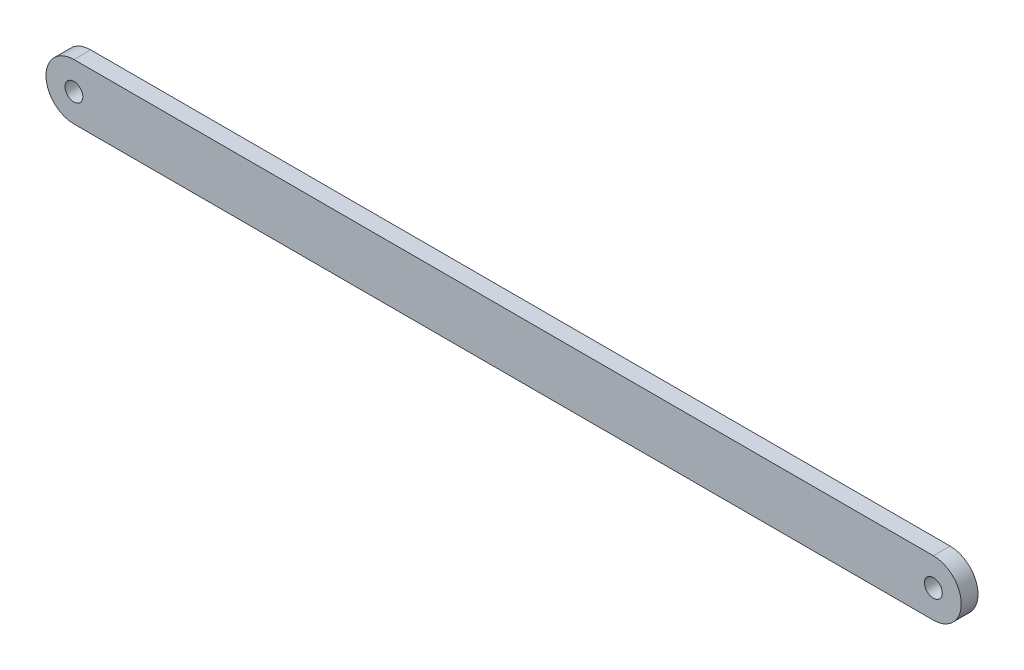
ISO-10303-21;
HEADER;
FILE_DESCRIPTION(('STEP AP214'),'2;1');
FILE_NAME('part.step','',(''),(''),'','','');
FILE_SCHEMA(('AUTOMOTIVE_DESIGN { 1 0 10303 214 1 1 1 1 }'));
ENDSEC;
DATA;
#1=APPLICATION_CONTEXT('core data for automotive mechanical design processes');
#2=APPLICATION_PROTOCOL_DEFINITION('international standard','automotive_design',2000,#1);
#3=PRODUCT_CONTEXT('',#1,'mechanical');
#4=PRODUCT('Part','Part','',(#3));
#5=PRODUCT_RELATED_PRODUCT_CATEGORY('part','',(#4));
#6=PRODUCT_DEFINITION_FORMATION('','',#4);
#7=PRODUCT_DEFINITION_CONTEXT('part definition',#1,'design');
#8=PRODUCT_DEFINITION('design','',#6,#7);
#9=PRODUCT_DEFINITION_SHAPE('','',#8);
#10=(LENGTH_UNIT() NAMED_UNIT(*) SI_UNIT(.MILLI.,.METRE.));
#11=(NAMED_UNIT(*) PLANE_ANGLE_UNIT() SI_UNIT($,.RADIAN.));
#12=(NAMED_UNIT(*) SI_UNIT($,.STERADIAN.) SOLID_ANGLE_UNIT());
#13=UNCERTAINTY_MEASURE_WITH_UNIT(LENGTH_MEASURE(1.E-05),#10,'distance_accuracy_value','');
#14=(GEOMETRIC_REPRESENTATION_CONTEXT(3) GLOBAL_UNCERTAINTY_ASSIGNED_CONTEXT((#13)) GLOBAL_UNIT_ASSIGNED_CONTEXT((#10,
#11,#12)) REPRESENTATION_CONTEXT('',''));
#15=CARTESIAN_POINT('',(0.,0.,0.));
#16=DIRECTION('',(0.,0.,1.));
#17=DIRECTION('',(1.,0.,0.));
#18=AXIS2_PLACEMENT_3D('',#15,#16,#17);
#19=CARTESIAN_POINT('',(180.,26.,3.));
#20=DIRECTION('',(0.,0.,1.));
#21=DIRECTION('',(1.,0.,0.));
#22=AXIS2_PLACEMENT_3D('',#19,#20,#21);
#23=PLANE('',#22);
#24=CARTESIAN_POINT('',(180.,26.,3.));
#25=DIRECTION('',(0.,0.,1.));
#26=DIRECTION('',(1.,0.,0.));
#27=AXIS2_PLACEMENT_3D('',#24,#25,#26);
#28=CIRCLE('',#27,1.60000000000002);
#29=CARTESIAN_POINT('',(181.6,26.,3.));
#30=VERTEX_POINT('',#29);
#31=EDGE_CURVE('E99',#30,#30,#28,.T.);
#32=ORIENTED_EDGE('',*,*,#31,.F.);
#33=EDGE_LOOP('',(#32));
#34=FACE_BOUND('',#33,.T.);
#35=CARTESIAN_POINT('',(180.,26.,3.));
#36=DIRECTION('',(0.,0.,1.));
#37=DIRECTION('',(1.,0.,0.));
#38=AXIS2_PLACEMENT_3D('',#35,#36,#37);
#39=CIRCLE('',#38,4.99999999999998);
#40=CARTESIAN_POINT('',(180.,21.,3.));
#41=VERTEX_POINT('',#40);
#42=CARTESIAN_POINT('',(180.,31.,3.));
#43=VERTEX_POINT('',#42);
#44=EDGE_CURVE('E84',#41,#43,#39,.T.);
#45=ORIENTED_EDGE('',*,*,#44,.T.);
#46=DIRECTION('',(-1.,0.,0.));
#47=VECTOR('',#46,1.);
#48=CARTESIAN_POINT('',(26.0000000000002,31.,3.));
#49=LINE('',#48,#47);
#50=CARTESIAN_POINT('',(26.0000000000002,31.,3.));
#51=VERTEX_POINT('',#50);
#52=EDGE_CURVE('E79',#43,#51,#49,.T.);
#53=ORIENTED_EDGE('',*,*,#52,.T.);
#54=CARTESIAN_POINT('',(26.0000000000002,26.,3.));
#55=DIRECTION('',(0.,0.,1.));
#56=DIRECTION('',(1.,0.,0.));
#57=AXIS2_PLACEMENT_3D('',#54,#55,#56);
#58=CIRCLE('',#57,5.);
#59=CARTESIAN_POINT('',(26.0000000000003,21.,3.));
#60=VERTEX_POINT('',#59);
#61=EDGE_CURVE('E82',#51,#60,#58,.T.);
#62=ORIENTED_EDGE('',*,*,#61,.T.);
#63=DIRECTION('',(1.,0.,0.));
#64=VECTOR('',#63,1.);
#65=CARTESIAN_POINT('',(26.0000000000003,21.,3.));
#66=LINE('',#65,#64);
#67=EDGE_CURVE('E49',#60,#41,#66,.T.);
#68=ORIENTED_EDGE('',*,*,#67,.T.);
#69=EDGE_LOOP('',(#45,#53,#62,#68));
#70=FACE_BOUND('',#69,.T.);
#71=CARTESIAN_POINT('',(26.0000000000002,26.,3.));
#72=DIRECTION('',(0.,0.,1.));
#73=DIRECTION('',(1.,0.,0.));
#74=AXIS2_PLACEMENT_3D('',#71,#72,#73);
#75=CIRCLE('',#74,1.6);
#76=CARTESIAN_POINT('',(27.6000000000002,26.,3.));
#77=VERTEX_POINT('',#76);
#78=EDGE_CURVE('E114',#77,#77,#75,.T.);
#79=ORIENTED_EDGE('',*,*,#78,.F.);
#80=EDGE_LOOP('',(#79));
#81=FACE_BOUND('',#80,.T.);
#82=ADVANCED_FACE('F32',(#34,#70,#81),#23,.T.);
#83=CARTESIAN_POINT('',(180.,26.,0.));
#84=DIRECTION('',(0.,0.,1.));
#85=DIRECTION('',(1.,0.,0.));
#86=AXIS2_PLACEMENT_3D('',#83,#84,#85);
#87=PLANE('',#86);
#88=CARTESIAN_POINT('',(180.,26.,0.));
#89=DIRECTION('',(0.,0.,1.));
#90=DIRECTION('',(1.,0.,0.));
#91=AXIS2_PLACEMENT_3D('',#88,#89,#90);
#92=CIRCLE('',#91,1.60000000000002);
#93=CARTESIAN_POINT('',(181.6,26.,0.));
#94=VERTEX_POINT('',#93);
#95=EDGE_CURVE('E111',#94,#94,#92,.T.);
#96=ORIENTED_EDGE('',*,*,#95,.T.);
#97=EDGE_LOOP('',(#96));
#98=FACE_BOUND('',#97,.T.);
#99=CARTESIAN_POINT('',(180.,26.,0.));
#100=DIRECTION('',(0.,0.,1.));
#101=DIRECTION('',(1.,0.,0.));
#102=AXIS2_PLACEMENT_3D('',#99,#100,#101);
#103=CIRCLE('',#102,4.99999999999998);
#104=CARTESIAN_POINT('',(180.,21.,0.));
#105=VERTEX_POINT('',#104);
#106=CARTESIAN_POINT('',(180.,31.,0.));
#107=VERTEX_POINT('',#106);
#108=EDGE_CURVE('E96',#105,#107,#103,.T.);
#109=ORIENTED_EDGE('',*,*,#108,.F.);
#110=DIRECTION('',(1.,0.,0.));
#111=VECTOR('',#110,1.);
#112=CARTESIAN_POINT('',(26.0000000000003,21.,0.));
#113=LINE('',#112,#111);
#114=CARTESIAN_POINT('',(26.0000000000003,21.,0.));
#115=VERTEX_POINT('',#114);
#116=EDGE_CURVE('E72',#115,#105,#113,.T.);
#117=ORIENTED_EDGE('',*,*,#116,.F.);
#118=CARTESIAN_POINT('',(26.0000000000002,26.,0.));
#119=DIRECTION('',(0.,0.,1.));
#120=DIRECTION('',(1.,0.,0.));
#121=AXIS2_PLACEMENT_3D('',#118,#119,#120);
#122=CIRCLE('',#121,5.);
#123=CARTESIAN_POINT('',(26.0000000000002,31.,0.));
#124=VERTEX_POINT('',#123);
#125=EDGE_CURVE('E66',#124,#115,#122,.T.);
#126=ORIENTED_EDGE('',*,*,#125,.F.);
#127=DIRECTION('',(-1.,0.,0.));
#128=VECTOR('',#127,1.);
#129=CARTESIAN_POINT('',(26.0000000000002,31.,0.));
#130=LINE('',#129,#128);
#131=EDGE_CURVE('E88',#107,#124,#130,.T.);
#132=ORIENTED_EDGE('',*,*,#131,.F.);
#133=EDGE_LOOP('',(#109,#117,#126,#132));
#134=FACE_BOUND('',#133,.T.);
#135=CARTESIAN_POINT('',(26.0000000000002,26.,0.));
#136=DIRECTION('',(0.,0.,1.));
#137=DIRECTION('',(1.,0.,0.));
#138=AXIS2_PLACEMENT_3D('',#135,#136,#137);
#139=CIRCLE('',#138,1.6);
#140=CARTESIAN_POINT('',(27.6000000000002,26.,0.));
#141=VERTEX_POINT('',#140);
#142=EDGE_CURVE('E117',#141,#141,#139,.T.);
#143=ORIENTED_EDGE('',*,*,#142,.T.);
#144=EDGE_LOOP('',(#143));
#145=FACE_BOUND('',#144,.T.);
#146=ADVANCED_FACE('F107',(#98,#134,#145),#87,.F.);
#147=CARTESIAN_POINT('',(180.,26.,3.));
#148=DIRECTION('',(0.,0.,-1.));
#149=DIRECTION('',(-1.,0.,0.));
#150=AXIS2_PLACEMENT_3D('',#147,#148,#149);
#151=CYLINDRICAL_SURFACE('',#150,4.99999999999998);
#152=ORIENTED_EDGE('',*,*,#108,.T.);
#153=DIRECTION('',(0.,0.,-1.));
#154=VECTOR('',#153,1.);
#155=CARTESIAN_POINT('',(180.,31.,3.));
#156=LINE('',#155,#154);
#157=EDGE_CURVE('E11',#43,#107,#156,.T.);
#158=ORIENTED_EDGE('',*,*,#157,.F.);
#159=ORIENTED_EDGE('',*,*,#44,.F.);
#160=DIRECTION('',(0.,0.,-1.));
#161=VECTOR('',#160,1.);
#162=CARTESIAN_POINT('',(180.,21.,3.));
#163=LINE('',#162,#161);
#164=EDGE_CURVE('E92',#41,#105,#163,.T.);
#165=ORIENTED_EDGE('',*,*,#164,.T.);
#166=EDGE_LOOP('',(#152,#158,#159,#165));
#167=FACE_BOUND('',#166,.T.);
#168=ADVANCED_FACE('F34',(#167),#151,.T.);
#169=CARTESIAN_POINT('',(26.0000000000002,31.,3.));
#170=DIRECTION('',(0.,-1.,0.));
#171=DIRECTION('',(0.,0.,-1.));
#172=AXIS2_PLACEMENT_3D('',#169,#170,#171);
#173=PLANE('',#172);
#174=ORIENTED_EDGE('',*,*,#131,.T.);
#175=DIRECTION('',(0.,0.,-1.));
#176=VECTOR('',#175,1.);
#177=CARTESIAN_POINT('',(26.0000000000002,31.,3.));
#178=LINE('',#177,#176);
#179=EDGE_CURVE('E41',#51,#124,#178,.T.);
#180=ORIENTED_EDGE('',*,*,#179,.F.);
#181=ORIENTED_EDGE('',*,*,#52,.F.);
#182=ORIENTED_EDGE('',*,*,#157,.T.);
#183=EDGE_LOOP('',(#174,#180,#181,#182));
#184=FACE_BOUND('',#183,.T.);
#185=ADVANCED_FACE('F87',(#184),#173,.F.);
#186=CARTESIAN_POINT('',(26.0000000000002,26.,3.));
#187=DIRECTION('',(0.,0.,-1.));
#188=DIRECTION('',(-1.,0.,0.));
#189=AXIS2_PLACEMENT_3D('',#186,#187,#188);
#190=CYLINDRICAL_SURFACE('',#189,5.);
#191=ORIENTED_EDGE('',*,*,#125,.T.);
#192=DIRECTION('',(0.,0.,-1.));
#193=VECTOR('',#192,1.);
#194=CARTESIAN_POINT('',(26.0000000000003,21.,3.));
#195=LINE('',#194,#193);
#196=EDGE_CURVE('E89',#60,#115,#195,.T.);
#197=ORIENTED_EDGE('',*,*,#196,.F.);
#198=ORIENTED_EDGE('',*,*,#61,.F.);
#199=ORIENTED_EDGE('',*,*,#179,.T.);
#200=EDGE_LOOP('',(#191,#197,#198,#199));
#201=FACE_BOUND('',#200,.T.);
#202=ADVANCED_FACE('F90',(#201),#190,.T.);
#203=CARTESIAN_POINT('',(26.0000000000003,21.,3.));
#204=DIRECTION('',(0.,1.,0.));
#205=DIRECTION('',(-1.,0.,0.));
#206=AXIS2_PLACEMENT_3D('',#203,#204,#205);
#207=PLANE('',#206);
#208=ORIENTED_EDGE('',*,*,#116,.T.);
#209=ORIENTED_EDGE('',*,*,#164,.F.);
#210=ORIENTED_EDGE('',*,*,#67,.F.);
#211=ORIENTED_EDGE('',*,*,#196,.T.);
#212=EDGE_LOOP('',(#208,#209,#210,#211));
#213=FACE_BOUND('',#212,.T.);
#214=ADVANCED_FACE('F104',(#213),#207,.F.);
#215=CARTESIAN_POINT('',(180.,26.,3.));
#216=DIRECTION('',(0.,0.,-1.));
#217=DIRECTION('',(-1.,0.,0.));
#218=AXIS2_PLACEMENT_3D('',#215,#216,#217);
#219=CYLINDRICAL_SURFACE('',#218,1.60000000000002);
#220=ORIENTED_EDGE('',*,*,#31,.T.);
#221=EDGE_LOOP('',(#220));
#222=FACE_BOUND('',#221,.T.);
#223=ORIENTED_EDGE('',*,*,#95,.F.);
#224=EDGE_LOOP('',(#223));
#225=FACE_BOUND('',#224,.T.);
#226=ADVANCED_FACE('F135',(#222,#225),#219,.F.);
#227=CARTESIAN_POINT('',(26.0000000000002,26.,3.));
#228=DIRECTION('',(0.,0.,-1.));
#229=DIRECTION('',(-1.,0.,0.));
#230=AXIS2_PLACEMENT_3D('',#227,#228,#229);
#231=CYLINDRICAL_SURFACE('',#230,1.6);
#232=ORIENTED_EDGE('',*,*,#78,.T.);
#233=EDGE_LOOP('',(#232));
#234=FACE_BOUND('',#233,.T.);
#235=ORIENTED_EDGE('',*,*,#142,.F.);
#236=EDGE_LOOP('',(#235));
#237=FACE_BOUND('',#236,.T.);
#238=ADVANCED_FACE('F123',(#234,#237),#231,.F.);
#239=CLOSED_SHELL('',(#82,#146,#168,#185,#202,#214,#226,#238));
#240=MANIFOLD_SOLID_BREP('B2',#239);
#241=ADVANCED_BREP_SHAPE_REPRESENTATION('',(#18,#240),#14);
#242=SHAPE_DEFINITION_REPRESENTATION(#9,#241);
ENDSEC;
END-ISO-10303-21;
